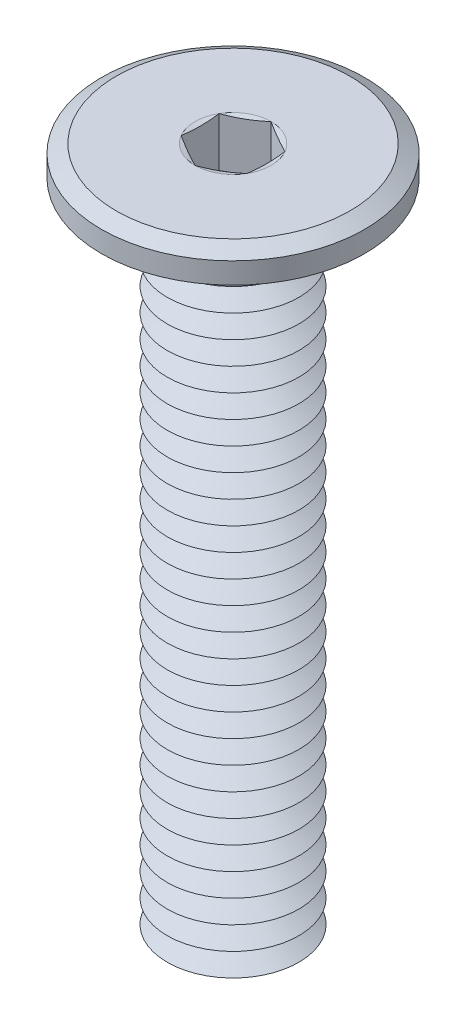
from build123d import *

# Parameters (mm, degrees)
SKETCH1_R           = 4
BOSS_EXTRUDE1_DEPTH = 0.9
SKETCH2_R           = 2
BOSS_EXTRUDE2_DEPTH = 20
LPATTERN1_COUNT     = 27
LPATTERN1_PITCH     = 0.7
FILLET1_R           = 0.2
CHAMFER2_SIZE       = 0.45
CHAMFER2_SIZE2      = 0.259807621
CUT_EXTRUDE1_DEPTH  = 1.5


with BuildPart() as part:
    # Sketch1 → Boss-Extrude1 (new body)
    with BuildSketch(Plane(origin=(0, 0, 0), x_dir=(1, 0, 0), z_dir=(0, 1, 0))):
        with Locations(Location((0, 0, 0), (0, 0, 270))):
            Circle(SKETCH1_R)
    extrude(amount=-BOSS_EXTRUDE1_DEPTH)

    # Sketch2 → Boss-Extrude2 (add)
    with BuildSketch(Plane.XZ.offset(0.9)):
        with Locations(Location((0, 0, 0), (0, 0, 270))):
            Circle(SKETCH2_R)
    extrude(amount=BOSS_EXTRUDE2_DEPTH)

    # Sketch5 → Cut-Revolve1 (revolve, cut)
    with BuildSketch(Plane(origin=(0, 0, 0), x_dir=(0, 0, -1), z_dir=(1, 0, 0))):
        Polygon((-2, -21.25), (-1.393782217, -20.9), (-2, -20.55), align=None)
    cut_revolve1 = revolve(axis=Axis((0, 0.990593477, 0), (0, -1, 0)), mode=Mode.SUBTRACT)

    # LPattern1: Cut-Revolve1 ×27
    with Locations(*[(0, i * LPATTERN1_PITCH, 0) for i in range(1, LPATTERN1_COUNT)]):
        add(cut_revolve1, mode=Mode.SUBTRACT)

    # Fillet1
    fillet1_edges = [part.edges().sort_by_distance(p)[0] for p in [
        (0, -0.9, 2),
    ]]
    fillet(fillet1_edges, radius=FILLET1_R)

    # Chamfer2
    chamfer2_edges = [part.edges().sort_by_distance(p)[0] for p in [
        (0, 0, -4),
    ]]
    chamfer2_side = [part.faces().sort_by_distance(p)[0] for p in [
        (0, 0, 0),
    ]]
    chamfer(chamfer2_edges, length=CHAMFER2_SIZE, length2=CHAMFER2_SIZE2, reference=chamfer2_side[0])

    # Sketch6 → Cut-Extrude1 (cut)
    with BuildSketch(Plane(origin=(0, 0, 0), x_dir=(1, 0, 0), z_dir=(0, 1, 0))):
        Polygon((0, 1.154700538), (-1, 0.577350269), (-1, -0.577350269), (0, -1.154700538), (1, -0.577350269), (1, 0.577350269), align=None)
    extrude(amount=-CUT_EXTRUDE1_DEPTH, mode=Mode.SUBTRACT)

    # Cut-Extrude2 cone 1 section (on through the dimple's axis) → Cut-Extrude2 (revolve, cut)
    with BuildSketch(Plane(origin=(0, -1.5, 0), x_dir=(0, 0, 1), z_dir=(1, 0, 0))):
        Polygon((0, 0), (1, 0), (0, 0.577350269), align=None)
    revolve(axis=Axis((0, -1.5, 0), (0, -1, 0)), mode=Mode.SUBTRACT)

    # Cut-Extrude3 cone 1 section (on through the dimple's axis) → Cut-Extrude3 (revolve, cut)
    with BuildSketch(Plane(origin=(0, 0, 0), x_dir=(0, 0, 1), z_dir=(1, 0, 0))):
        Polygon((0, 0), (1.154700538, 0), (0, 0.309401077), align=None)
    revolve(axis=Axis((0, 0, 0), (0, -1, 0)), mode=Mode.SUBTRACT)


solid = part.part
